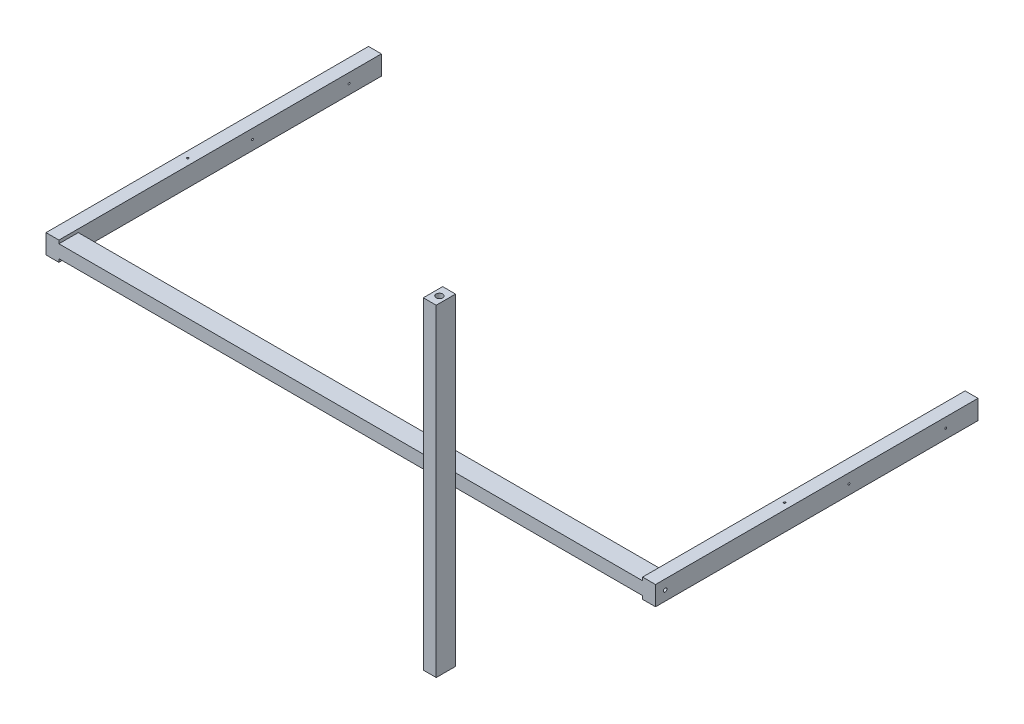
ISO-10303-21;
HEADER;
FILE_DESCRIPTION(('STEP AP214'),'2;1');
FILE_NAME('part.step','',(''),(''),'','','');
FILE_SCHEMA(('AUTOMOTIVE_DESIGN { 1 0 10303 214 1 1 1 1 }'));
ENDSEC;
DATA;
#1=APPLICATION_CONTEXT('core data for automotive mechanical design processes');
#2=APPLICATION_PROTOCOL_DEFINITION('international standard','automotive_design',2000,#1);
#3=PRODUCT_CONTEXT('',#1,'mechanical');
#4=PRODUCT('Part','Part','',(#3));
#5=PRODUCT_RELATED_PRODUCT_CATEGORY('part','',(#4));
#6=PRODUCT_DEFINITION_FORMATION('','',#4);
#7=PRODUCT_DEFINITION_CONTEXT('part definition',#1,'design');
#8=PRODUCT_DEFINITION('design','',#6,#7);
#9=PRODUCT_DEFINITION_SHAPE('','',#8);
#10=(LENGTH_UNIT() NAMED_UNIT(*) SI_UNIT(.MILLI.,.METRE.));
#11=(NAMED_UNIT(*) PLANE_ANGLE_UNIT() SI_UNIT($,.RADIAN.));
#12=(NAMED_UNIT(*) SI_UNIT($,.STERADIAN.) SOLID_ANGLE_UNIT());
#13=UNCERTAINTY_MEASURE_WITH_UNIT(LENGTH_MEASURE(1.E-05),#10,'distance_accuracy_value','');
#14=(GEOMETRIC_REPRESENTATION_CONTEXT(3) GLOBAL_UNCERTAINTY_ASSIGNED_CONTEXT((#13)) GLOBAL_UNIT_ASSIGNED_CONTEXT((#10,
#11,#12)) REPRESENTATION_CONTEXT('',''));
#15=CARTESIAN_POINT('',(0.,0.,0.));
#16=DIRECTION('',(0.,0.,1.));
#17=DIRECTION('',(1.,0.,0.));
#18=AXIS2_PLACEMENT_3D('',#15,#16,#17);
#19=CARTESIAN_POINT('',(285.,500.,1000.));
#20=DIRECTION('',(1.,0.,0.));
#21=DIRECTION('',(0.,0.,-1.));
#22=AXIS2_PLACEMENT_3D('',#19,#20,#21);
#23=PLANE('',#22);
#24=DIRECTION('',(0.,0.,1.));
#25=VECTOR('',#24,1.);
#26=CARTESIAN_POINT('',(285.,-500.,1000.));
#27=LINE('',#26,#25);
#28=CARTESIAN_POINT('',(285.,-500.,1000.));
#29=VERTEX_POINT('',#28);
#30=CARTESIAN_POINT('',(285.,-500.,1060.));
#31=VERTEX_POINT('',#30);
#32=EDGE_CURVE('E112',#29,#31,#27,.T.);
#33=ORIENTED_EDGE('',*,*,#32,.T.);
#34=DIRECTION('',(0.,-1.,0.));
#35=VECTOR('',#34,1.);
#36=CARTESIAN_POINT('',(285.,500.,1060.));
#37=LINE('',#36,#35);
#38=CARTESIAN_POINT('',(285.,500.,1060.));
#39=VERTEX_POINT('',#38);
#40=EDGE_CURVE('E12',#39,#31,#37,.T.);
#41=ORIENTED_EDGE('',*,*,#40,.F.);
#42=DIRECTION('',(0.,0.,1.));
#43=VECTOR('',#42,1.);
#44=CARTESIAN_POINT('',(285.,500.,1000.));
#45=LINE('',#44,#43);
#46=CARTESIAN_POINT('',(285.,500.,1000.));
#47=VERTEX_POINT('',#46);
#48=EDGE_CURVE('E99',#47,#39,#45,.T.);
#49=ORIENTED_EDGE('',*,*,#48,.F.);
#50=DIRECTION('',(0.,-1.,0.));
#51=VECTOR('',#50,1.);
#52=CARTESIAN_POINT('',(285.,500.,1000.));
#53=LINE('',#52,#51);
#54=EDGE_CURVE('E108',#47,#29,#53,.T.);
#55=ORIENTED_EDGE('',*,*,#54,.T.);
#56=EDGE_LOOP('',(#33,#41,#49,#55));
#57=FACE_BOUND('',#56,.T.);
#58=ADVANCED_FACE('F47',(#57),#23,.F.);
#59=CARTESIAN_POINT('',(285.,500.,1060.));
#60=DIRECTION('',(0.,0.,-1.));
#61=DIRECTION('',(-1.,0.,0.));
#62=AXIS2_PLACEMENT_3D('',#59,#60,#61);
#63=PLANE('',#62);
#64=DIRECTION('',(1.,0.,0.));
#65=VECTOR('',#64,1.);
#66=CARTESIAN_POINT('',(285.,-500.,1060.));
#67=LINE('',#66,#65);
#68=CARTESIAN_POINT('',(325.,-500.,1060.));
#69=VERTEX_POINT('',#68);
#70=EDGE_CURVE('E103',#31,#69,#67,.T.);
#71=ORIENTED_EDGE('',*,*,#70,.T.);
#72=DIRECTION('',(0.,-1.,0.));
#73=VECTOR('',#72,1.);
#74=CARTESIAN_POINT('',(325.,500.,1060.));
#75=LINE('',#74,#73);
#76=CARTESIAN_POINT('',(325.,500.,1060.));
#77=VERTEX_POINT('',#76);
#78=EDGE_CURVE('E56',#77,#69,#75,.T.);
#79=ORIENTED_EDGE('',*,*,#78,.F.);
#80=DIRECTION('',(1.,0.,0.));
#81=VECTOR('',#80,1.);
#82=CARTESIAN_POINT('',(285.,500.,1060.));
#83=LINE('',#82,#81);
#84=EDGE_CURVE('E94',#39,#77,#83,.T.);
#85=ORIENTED_EDGE('',*,*,#84,.F.);
#86=ORIENTED_EDGE('',*,*,#40,.T.);
#87=EDGE_LOOP('',(#71,#79,#85,#86));
#88=FACE_BOUND('',#87,.T.);
#89=ADVANCED_FACE('F102',(#88),#63,.F.);
#90=CARTESIAN_POINT('',(325.,500.,1000.));
#91=DIRECTION('',(-1.,0.,0.));
#92=DIRECTION('',(0.,0.,1.));
#93=AXIS2_PLACEMENT_3D('',#90,#91,#92);
#94=PLANE('',#93);
#95=DIRECTION('',(0.,0.,-1.));
#96=VECTOR('',#95,1.);
#97=CARTESIAN_POINT('',(325.,-500.,1000.));
#98=LINE('',#97,#96);
#99=CARTESIAN_POINT('',(325.,-500.,1000.));
#100=VERTEX_POINT('',#99);
#101=EDGE_CURVE('E81',#69,#100,#98,.T.);
#102=ORIENTED_EDGE('',*,*,#101,.T.);
#103=DIRECTION('',(0.,-1.,0.));
#104=VECTOR('',#103,1.);
#105=CARTESIAN_POINT('',(325.,500.,1000.));
#106=LINE('',#105,#104);
#107=CARTESIAN_POINT('',(325.,500.,1000.));
#108=VERTEX_POINT('',#107);
#109=EDGE_CURVE('E104',#108,#100,#106,.T.);
#110=ORIENTED_EDGE('',*,*,#109,.F.);
#111=DIRECTION('',(0.,0.,-1.));
#112=VECTOR('',#111,1.);
#113=CARTESIAN_POINT('',(325.,500.,1000.));
#114=LINE('',#113,#112);
#115=EDGE_CURVE('E97',#77,#108,#114,.T.);
#116=ORIENTED_EDGE('',*,*,#115,.F.);
#117=ORIENTED_EDGE('',*,*,#78,.T.);
#118=EDGE_LOOP('',(#102,#110,#116,#117));
#119=FACE_BOUND('',#118,.T.);
#120=ADVANCED_FACE('F106',(#119),#94,.F.);
#121=CARTESIAN_POINT('',(285.,500.,1000.));
#122=DIRECTION('',(0.,0.,1.));
#123=DIRECTION('',(1.,0.,0.));
#124=AXIS2_PLACEMENT_3D('',#121,#122,#123);
#125=PLANE('',#124);
#126=DIRECTION('',(-1.,0.,0.));
#127=VECTOR('',#126,1.);
#128=CARTESIAN_POINT('',(285.,-500.,1000.));
#129=LINE('',#128,#127);
#130=EDGE_CURVE('E87',#100,#29,#129,.T.);
#131=ORIENTED_EDGE('',*,*,#130,.T.);
#132=ORIENTED_EDGE('',*,*,#54,.F.);
#133=DIRECTION('',(-1.,0.,0.));
#134=VECTOR('',#133,1.);
#135=CARTESIAN_POINT('',(285.,500.,1000.));
#136=LINE('',#135,#134);
#137=EDGE_CURVE('E64',#108,#47,#136,.T.);
#138=ORIENTED_EDGE('',*,*,#137,.F.);
#139=ORIENTED_EDGE('',*,*,#109,.T.);
#140=EDGE_LOOP('',(#131,#132,#138,#139));
#141=FACE_BOUND('',#140,.T.);
#142=ADVANCED_FACE('F119',(#141),#125,.F.);
#143=CARTESIAN_POINT('',(0.,500.,0.));
#144=DIRECTION('',(0.,1.,0.));
#145=DIRECTION('',(0.,0.,1.));
#146=AXIS2_PLACEMENT_3D('',#143,#144,#145);
#147=PLANE('',#146);
#148=CARTESIAN_POINT('',(305.,500.,1030.));
#149=DIRECTION('',(0.,-1.,0.));
#150=DIRECTION('',(0.,0.,-1.));
#151=AXIS2_PLACEMENT_3D('',#148,#149,#150);
#152=CIRCLE('',#151,10.3434459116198);
#153=CARTESIAN_POINT('',(305.,500.,1019.65655408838));
#154=VERTEX_POINT('',#153);
#155=EDGE_CURVE('E125',#154,#154,#152,.T.);
#156=ORIENTED_EDGE('',*,*,#155,.T.);
#157=EDGE_LOOP('',(#156));
#158=FACE_BOUND('',#157,.T.);
#159=ORIENTED_EDGE('',*,*,#48,.T.);
#160=ORIENTED_EDGE('',*,*,#84,.T.);
#161=ORIENTED_EDGE('',*,*,#115,.T.);
#162=ORIENTED_EDGE('',*,*,#137,.T.);
#163=EDGE_LOOP('',(#159,#160,#161,#162));
#164=FACE_BOUND('',#163,.T.);
#165=ADVANCED_FACE('F95',(#158,#164),#147,.T.);
#166=CARTESIAN_POINT('',(0.,-500.,0.));
#167=DIRECTION('',(0.,1.,0.));
#168=DIRECTION('',(0.,0.,1.));
#169=AXIS2_PLACEMENT_3D('',#166,#167,#168);
#170=PLANE('',#169);
#171=CARTESIAN_POINT('',(305.,-500.,1030.));
#172=DIRECTION('',(0.,1.,0.));
#173=DIRECTION('',(0.,0.,1.));
#174=AXIS2_PLACEMENT_3D('',#171,#172,#173);
#175=CIRCLE('',#174,10.3434459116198);
#176=CARTESIAN_POINT('',(305.,-500.,1040.34344591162));
#177=VERTEX_POINT('',#176);
#178=EDGE_CURVE('E50',#177,#177,#175,.T.);
#179=ORIENTED_EDGE('',*,*,#178,.T.);
#180=EDGE_LOOP('',(#179));
#181=FACE_BOUND('',#180,.T.);
#182=ORIENTED_EDGE('',*,*,#32,.F.);
#183=ORIENTED_EDGE('',*,*,#130,.F.);
#184=ORIENTED_EDGE('',*,*,#101,.F.);
#185=ORIENTED_EDGE('',*,*,#70,.F.);
#186=EDGE_LOOP('',(#182,#183,#184,#185));
#187=FACE_BOUND('',#186,.T.);
#188=ADVANCED_FACE('F122',(#181,#187),#170,.F.);
#189=CARTESIAN_POINT('',(305.,500.,1030.));
#190=DIRECTION('',(0.,-1.,0.));
#191=DIRECTION('',(0.,0.,-1.));
#192=AXIS2_PLACEMENT_3D('',#189,#190,#191);
#193=CYLINDRICAL_SURFACE('',#192,10.3434459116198);
#194=ORIENTED_EDGE('',*,*,#155,.F.);
#195=EDGE_LOOP('',(#194));
#196=FACE_BOUND('',#195,.T.);
#197=ORIENTED_EDGE('',*,*,#178,.F.);
#198=EDGE_LOOP('',(#197));
#199=FACE_BOUND('',#198,.T.);
#200=ADVANCED_FACE('F133',(#196,#199),#193,.F.);
#201=CLOSED_SHELL('',(#58,#89,#120,#142,#165,#188,#200));
#202=MANIFOLD_SOLID_BREP('B2',#201);
#203=CARTESIAN_POINT('',(-905.,-30.,1000.));
#204=DIRECTION('',(-1.,0.,0.));
#205=DIRECTION('',(0.,0.,1.));
#206=AXIS2_PLACEMENT_3D('',#203,#204,#205);
#207=PLANE('',#206);
#208=CARTESIAN_POINT('',(-905.,0.,400.));
#209=DIRECTION('',(-1.,0.,0.));
#210=DIRECTION('',(0.,0.,1.));
#211=AXIS2_PLACEMENT_3D('',#208,#209,#210);
#212=CIRCLE('',#211,2.99999999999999);
#213=CARTESIAN_POINT('',(-905.,0.,403.));
#214=VERTEX_POINT('',#213);
#215=EDGE_CURVE('E495',#214,#214,#212,.T.);
#216=ORIENTED_EDGE('',*,*,#215,.T.);
#217=EDGE_LOOP('',(#216));
#218=FACE_BOUND('',#217,.T.);
#219=CARTESIAN_POINT('',(-905.,0.,100.));
#220=DIRECTION('',(-1.,0.,0.));
#221=DIRECTION('',(0.,0.,1.));
#222=AXIS2_PLACEMENT_3D('',#219,#220,#221);
#223=CIRCLE('',#222,2.99999999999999);
#224=CARTESIAN_POINT('',(-905.,0.,103.));
#225=VERTEX_POINT('',#224);
#226=EDGE_CURVE('E366',#225,#225,#223,.T.);
#227=ORIENTED_EDGE('',*,*,#226,.T.);
#228=EDGE_LOOP('',(#227));
#229=FACE_BOUND('',#228,.T.);
#230=DIRECTION('',(0.,0.,1.));
#231=VECTOR('',#230,1.);
#232=CARTESIAN_POINT('',(-905.,20.,940.));
#233=LINE('',#232,#231);
#234=CARTESIAN_POINT('',(-905.,20.,940.));
#235=VERTEX_POINT('',#234);
#236=CARTESIAN_POINT('',(-905.,20.,1000.));
#237=VERTEX_POINT('',#236);
#238=EDGE_CURVE('E209',#235,#237,#233,.T.);
#239=ORIENTED_EDGE('',*,*,#238,.F.);
#240=DIRECTION('',(0.,1.,0.));
#241=VECTOR('',#240,1.);
#242=CARTESIAN_POINT('',(-905.,-20.,940.));
#243=LINE('',#242,#241);
#244=CARTESIAN_POINT('',(-905.,-20.,940.));
#245=VERTEX_POINT('',#244);
#246=EDGE_CURVE('E313',#245,#235,#243,.T.);
#247=ORIENTED_EDGE('',*,*,#246,.F.);
#248=DIRECTION('',(0.,0.,-1.));
#249=VECTOR('',#248,1.);
#250=CARTESIAN_POINT('',(-905.,-20.,940.));
#251=LINE('',#250,#249);
#252=CARTESIAN_POINT('',(-905.,-20.,1000.));
#253=VERTEX_POINT('',#252);
#254=EDGE_CURVE('E310',#253,#245,#251,.T.);
#255=ORIENTED_EDGE('',*,*,#254,.F.);
#256=DIRECTION('',(0.,1.,0.));
#257=VECTOR('',#256,1.);
#258=CARTESIAN_POINT('',(-905.,-30.,1000.));
#259=LINE('',#258,#257);
#260=CARTESIAN_POINT('',(-905.,-30.,1000.));
#261=VERTEX_POINT('',#260);
#262=EDGE_CURVE('E345',#261,#253,#259,.T.);
#263=ORIENTED_EDGE('',*,*,#262,.F.);
#264=DIRECTION('',(0.,0.,-1.));
#265=VECTOR('',#264,1.);
#266=CARTESIAN_POINT('',(-905.,-30.,1000.));
#267=LINE('',#266,#265);
#268=CARTESIAN_POINT('',(-905.,-30.,0.));
#269=VERTEX_POINT('',#268);
#270=EDGE_CURVE('E201',#261,#269,#267,.T.);
#271=ORIENTED_EDGE('',*,*,#270,.T.);
#272=DIRECTION('',(0.,1.,0.));
#273=VECTOR('',#272,1.);
#274=CARTESIAN_POINT('',(-905.,-30.,0.));
#275=LINE('',#274,#273);
#276=CARTESIAN_POINT('',(-905.,30.,0.));
#277=VERTEX_POINT('',#276);
#278=EDGE_CURVE('E354',#269,#277,#275,.T.);
#279=ORIENTED_EDGE('',*,*,#278,.T.);
#280=DIRECTION('',(0.,0.,-1.));
#281=VECTOR('',#280,1.);
#282=CARTESIAN_POINT('',(-905.,30.,1000.));
#283=LINE('',#282,#281);
#284=CARTESIAN_POINT('',(-905.,30.,1000.));
#285=VERTEX_POINT('',#284);
#286=EDGE_CURVE('E359',#285,#277,#283,.T.);
#287=ORIENTED_EDGE('',*,*,#286,.F.);
#288=EDGE_CURVE('E214',#237,#285,#259,.T.);
#289=ORIENTED_EDGE('',*,*,#288,.F.);
#290=EDGE_LOOP('',(#239,#247,#255,#263,#271,#279,#287,#289));
#291=FACE_BOUND('',#290,.T.);
#292=ADVANCED_FACE('F192',(#218,#229,#291),#207,.F.);
#293=CARTESIAN_POINT('',(-945.,-30.,1000.));
#294=DIRECTION('',(1.,0.,0.));
#295=DIRECTION('',(0.,0.,-1.));
#296=AXIS2_PLACEMENT_3D('',#293,#294,#295);
#297=PLANE('',#296);
#298=CARTESIAN_POINT('',(-945.,0.,970.));
#299=DIRECTION('',(-1.,0.,0.));
#300=DIRECTION('',(0.,0.,1.));
#301=AXIS2_PLACEMENT_3D('',#298,#299,#300);
#302=CIRCLE('',#301,5.49999999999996);
#303=CARTESIAN_POINT('',(-945.,0.,975.5));
#304=VERTEX_POINT('',#303);
#305=EDGE_CURVE('E504',#304,#304,#302,.T.);
#306=ORIENTED_EDGE('',*,*,#305,.F.);
#307=EDGE_LOOP('',(#306));
#308=FACE_BOUND('',#307,.T.);
#309=CARTESIAN_POINT('',(-945.,0.,400.));
#310=DIRECTION('',(-1.,0.,0.));
#311=DIRECTION('',(0.,0.,1.));
#312=AXIS2_PLACEMENT_3D('',#309,#310,#311);
#313=CIRCLE('',#312,2.99999999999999);
#314=CARTESIAN_POINT('',(-945.,0.,403.));
#315=VERTEX_POINT('',#314);
#316=EDGE_CURVE('E501',#315,#315,#313,.T.);
#317=ORIENTED_EDGE('',*,*,#316,.F.);
#318=EDGE_LOOP('',(#317));
#319=FACE_BOUND('',#318,.T.);
#320=CARTESIAN_POINT('',(-945.,0.,100.));
#321=DIRECTION('',(-1.,0.,0.));
#322=DIRECTION('',(0.,0.,1.));
#323=AXIS2_PLACEMENT_3D('',#320,#321,#322);
#324=CIRCLE('',#323,2.99999999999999);
#325=CARTESIAN_POINT('',(-945.,0.,103.));
#326=VERTEX_POINT('',#325);
#327=EDGE_CURVE('E498',#326,#326,#324,.T.);
#328=ORIENTED_EDGE('',*,*,#327,.F.);
#329=EDGE_LOOP('',(#328));
#330=FACE_BOUND('',#329,.T.);
#331=DIRECTION('',(0.,-1.,0.));
#332=VECTOR('',#331,1.);
#333=CARTESIAN_POINT('',(-945.,-30.,0.));
#334=LINE('',#333,#332);
#335=CARTESIAN_POINT('',(-945.,30.,0.));
#336=VERTEX_POINT('',#335);
#337=CARTESIAN_POINT('',(-945.,-30.,0.));
#338=VERTEX_POINT('',#337);
#339=EDGE_CURVE('E339',#336,#338,#334,.T.);
#340=ORIENTED_EDGE('',*,*,#339,.T.);
#341=DIRECTION('',(0.,0.,-1.));
#342=VECTOR('',#341,1.);
#343=CARTESIAN_POINT('',(-945.,-30.,1000.));
#344=LINE('',#343,#342);
#345=CARTESIAN_POINT('',(-945.,-30.,1000.));
#346=VERTEX_POINT('',#345);
#347=EDGE_CURVE('E45',#346,#338,#344,.T.);
#348=ORIENTED_EDGE('',*,*,#347,.F.);
#349=DIRECTION('',(0.,-1.,0.));
#350=VECTOR('',#349,1.);
#351=CARTESIAN_POINT('',(-945.,-30.,1000.));
#352=LINE('',#351,#350);
#353=CARTESIAN_POINT('',(-945.,30.,1000.));
#354=VERTEX_POINT('',#353);
#355=EDGE_CURVE('E340',#354,#346,#352,.T.);
#356=ORIENTED_EDGE('',*,*,#355,.F.);
#357=DIRECTION('',(0.,0.,-1.));
#358=VECTOR('',#357,1.);
#359=CARTESIAN_POINT('',(-945.,30.,1000.));
#360=LINE('',#359,#358);
#361=EDGE_CURVE('E349',#354,#336,#360,.T.);
#362=ORIENTED_EDGE('',*,*,#361,.T.);
#363=EDGE_LOOP('',(#340,#348,#356,#362));
#364=FACE_BOUND('',#363,.T.);
#365=ADVANCED_FACE('F194',(#308,#319,#330,#364),#297,.F.);
#366=CARTESIAN_POINT('',(-905.,-30.,1000.));
#367=DIRECTION('',(0.,1.,0.));
#368=DIRECTION('',(-1.,0.,0.));
#369=AXIS2_PLACEMENT_3D('',#366,#367,#368);
#370=PLANE('',#369);
#371=CARTESIAN_POINT('',(-925.,-30.,580.));
#372=DIRECTION('',(0.,1.,0.));
#373=DIRECTION('',(-1.,0.,0.));
#374=AXIS2_PLACEMENT_3D('',#371,#372,#373);
#375=CIRCLE('',#374,3.00000000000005);
#376=CARTESIAN_POINT('',(-928.,-30.,580.));
#377=VERTEX_POINT('',#376);
#378=EDGE_CURVE('E381',#377,#377,#375,.T.);
#379=ORIENTED_EDGE('',*,*,#378,.T.);
#380=EDGE_LOOP('',(#379));
#381=FACE_BOUND('',#380,.T.);
#382=DIRECTION('',(1.,0.,0.));
#383=VECTOR('',#382,1.);
#384=CARTESIAN_POINT('',(-905.,-30.,0.));
#385=LINE('',#384,#383);
#386=EDGE_CURVE('E352',#338,#269,#385,.T.);
#387=ORIENTED_EDGE('',*,*,#386,.T.);
#388=ORIENTED_EDGE('',*,*,#270,.F.);
#389=DIRECTION('',(1.,0.,0.));
#390=VECTOR('',#389,1.);
#391=CARTESIAN_POINT('',(-905.,-30.,1000.));
#392=LINE('',#391,#390);
#393=EDGE_CURVE('E342',#346,#261,#392,.T.);
#394=ORIENTED_EDGE('',*,*,#393,.F.);
#395=ORIENTED_EDGE('',*,*,#347,.T.);
#396=EDGE_LOOP('',(#387,#388,#394,#395));
#397=FACE_BOUND('',#396,.T.);
#398=ADVANCED_FACE('F425',(#381,#397),#370,.F.);
#399=CARTESIAN_POINT('',(-905.,30.,1000.));
#400=DIRECTION('',(0.,-1.,0.));
#401=DIRECTION('',(1.,0.,0.));
#402=AXIS2_PLACEMENT_3D('',#399,#400,#401);
#403=PLANE('',#402);
#404=CARTESIAN_POINT('',(-925.,30.,580.));
#405=DIRECTION('',(0.,-1.,0.));
#406=DIRECTION('',(1.,0.,0.));
#407=AXIS2_PLACEMENT_3D('',#404,#405,#406);
#408=CIRCLE('',#407,3.00000000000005);
#409=CARTESIAN_POINT('',(-922.,30.,580.));
#410=VERTEX_POINT('',#409);
#411=EDGE_CURVE('E196',#410,#410,#408,.T.);
#412=ORIENTED_EDGE('',*,*,#411,.T.);
#413=EDGE_LOOP('',(#412));
#414=FACE_BOUND('',#413,.T.);
#415=DIRECTION('',(-1.,0.,0.));
#416=VECTOR('',#415,1.);
#417=CARTESIAN_POINT('',(-905.,30.,0.));
#418=LINE('',#417,#416);
#419=EDGE_CURVE('E343',#277,#336,#418,.T.);
#420=ORIENTED_EDGE('',*,*,#419,.T.);
#421=ORIENTED_EDGE('',*,*,#361,.F.);
#422=DIRECTION('',(-1.,0.,0.));
#423=VECTOR('',#422,1.);
#424=CARTESIAN_POINT('',(-905.,30.,1000.));
#425=LINE('',#424,#423);
#426=EDGE_CURVE('E347',#285,#354,#425,.T.);
#427=ORIENTED_EDGE('',*,*,#426,.F.);
#428=ORIENTED_EDGE('',*,*,#286,.T.);
#429=EDGE_LOOP('',(#420,#421,#427,#428));
#430=FACE_BOUND('',#429,.T.);
#431=ADVANCED_FACE('F417',(#414,#430),#403,.F.);
#432=CARTESIAN_POINT('',(0.,0.,1000.));
#433=DIRECTION('',(0.,0.,1.));
#434=DIRECTION('',(1.,0.,0.));
#435=AXIS2_PLACEMENT_3D('',#432,#433,#434);
#436=PLANE('',#435);
#437=ORIENTED_EDGE('',*,*,#355,.T.);
#438=ORIENTED_EDGE('',*,*,#393,.T.);
#439=ORIENTED_EDGE('',*,*,#262,.T.);
#440=DIRECTION('',(-1.,0.,0.));
#441=VECTOR('',#440,1.);
#442=CARTESIAN_POINT('',(905.,-20.,1000.));
#443=LINE('',#442,#441);
#444=CARTESIAN_POINT('',(905.,-20.,1000.));
#445=VERTEX_POINT('',#444);
#446=EDGE_CURVE('E289',#445,#253,#443,.T.);
#447=ORIENTED_EDGE('',*,*,#446,.F.);
#448=DIRECTION('',(0.,-1.,0.));
#449=VECTOR('',#448,1.);
#450=CARTESIAN_POINT('',(905.,-30.,1000.));
#451=LINE('',#450,#449);
#452=CARTESIAN_POINT('',(905.,-30.,1000.));
#453=VERTEX_POINT('',#452);
#454=EDGE_CURVE('E281',#445,#453,#451,.T.);
#455=ORIENTED_EDGE('',*,*,#454,.T.);
#456=DIRECTION('',(1.,0.,0.));
#457=VECTOR('',#456,1.);
#458=CARTESIAN_POINT('',(905.,-30.,1000.));
#459=LINE('',#458,#457);
#460=CARTESIAN_POINT('',(945.,-30.,1000.));
#461=VERTEX_POINT('',#460);
#462=EDGE_CURVE('E285',#453,#461,#459,.T.);
#463=ORIENTED_EDGE('',*,*,#462,.T.);
#464=DIRECTION('',(0.,1.,0.));
#465=VECTOR('',#464,1.);
#466=CARTESIAN_POINT('',(945.,-30.,1000.));
#467=LINE('',#466,#465);
#468=CARTESIAN_POINT('',(945.,30.,1000.));
#469=VERTEX_POINT('',#468);
#470=EDGE_CURVE('E304',#461,#469,#467,.T.);
#471=ORIENTED_EDGE('',*,*,#470,.T.);
#472=DIRECTION('',(-1.,0.,0.));
#473=VECTOR('',#472,1.);
#474=CARTESIAN_POINT('',(905.,30.,1000.));
#475=LINE('',#474,#473);
#476=CARTESIAN_POINT('',(905.,30.,1000.));
#477=VERTEX_POINT('',#476);
#478=EDGE_CURVE('E386',#469,#477,#475,.T.);
#479=ORIENTED_EDGE('',*,*,#478,.T.);
#480=CARTESIAN_POINT('',(905.,20.,1000.));
#481=VERTEX_POINT('',#480);
#482=EDGE_CURVE('E293',#477,#481,#451,.T.);
#483=ORIENTED_EDGE('',*,*,#482,.T.);
#484=DIRECTION('',(-1.,0.,0.));
#485=VECTOR('',#484,1.);
#486=CARTESIAN_POINT('',(905.,20.,1000.));
#487=LINE('',#486,#485);
#488=EDGE_CURVE('E326',#481,#237,#487,.T.);
#489=ORIENTED_EDGE('',*,*,#488,.T.);
#490=ORIENTED_EDGE('',*,*,#288,.T.);
#491=ORIENTED_EDGE('',*,*,#426,.T.);
#492=EDGE_LOOP('',(#437,#438,#439,#447,#455,#463,#471,#479,#483,#489,#490,#491));
#493=FACE_BOUND('',#492,.T.);
#494=ADVANCED_FACE('F284',(#493),#436,.T.);
#495=CARTESIAN_POINT('',(0.,0.,0.));
#496=DIRECTION('',(0.,0.,1.));
#497=DIRECTION('',(1.,0.,0.));
#498=AXIS2_PLACEMENT_3D('',#495,#496,#497);
#499=PLANE('',#498);
#500=ORIENTED_EDGE('',*,*,#339,.F.);
#501=ORIENTED_EDGE('',*,*,#419,.F.);
#502=ORIENTED_EDGE('',*,*,#278,.F.);
#503=ORIENTED_EDGE('',*,*,#386,.F.);
#504=EDGE_LOOP('',(#500,#501,#502,#503));
#505=FACE_BOUND('',#504,.T.);
#506=ADVANCED_FACE('F437',(#505),#499,.F.);
#507=CARTESIAN_POINT('',(905.,-20.,940.));
#508=DIRECTION('',(0.,1.,0.));
#509=DIRECTION('',(0.,0.,1.));
#510=AXIS2_PLACEMENT_3D('',#507,#508,#509);
#511=PLANE('',#510);
#512=ORIENTED_EDGE('',*,*,#254,.T.);
#513=DIRECTION('',(-1.,0.,0.));
#514=VECTOR('',#513,1.);
#515=CARTESIAN_POINT('',(905.,-20.,940.));
#516=LINE('',#515,#514);
#517=CARTESIAN_POINT('',(905.,-20.,940.));
#518=VERTEX_POINT('',#517);
#519=EDGE_CURVE('E335',#518,#245,#516,.T.);
#520=ORIENTED_EDGE('',*,*,#519,.F.);
#521=DIRECTION('',(0.,0.,-1.));
#522=VECTOR('',#521,1.);
#523=CARTESIAN_POINT('',(905.,-20.,940.));
#524=LINE('',#523,#522);
#525=EDGE_CURVE('E319',#445,#518,#524,.T.);
#526=ORIENTED_EDGE('',*,*,#525,.F.);
#527=ORIENTED_EDGE('',*,*,#446,.T.);
#528=EDGE_LOOP('',(#512,#520,#526,#527));
#529=FACE_BOUND('',#528,.T.);
#530=ADVANCED_FACE('F427',(#529),#511,.F.);
#531=CARTESIAN_POINT('',(905.,-20.,940.));
#532=DIRECTION('',(0.,0.,1.));
#533=DIRECTION('',(1.,0.,0.));
#534=AXIS2_PLACEMENT_3D('',#531,#532,#533);
#535=PLANE('',#534);
#536=ORIENTED_EDGE('',*,*,#246,.T.);
#537=DIRECTION('',(-1.,0.,0.));
#538=VECTOR('',#537,1.);
#539=CARTESIAN_POINT('',(905.,20.,940.));
#540=LINE('',#539,#538);
#541=CARTESIAN_POINT('',(905.,20.,940.));
#542=VERTEX_POINT('',#541);
#543=EDGE_CURVE('E332',#542,#235,#540,.T.);
#544=ORIENTED_EDGE('',*,*,#543,.F.);
#545=DIRECTION('',(0.,1.,0.));
#546=VECTOR('',#545,1.);
#547=CARTESIAN_POINT('',(905.,-20.,940.));
#548=LINE('',#547,#546);
#549=EDGE_CURVE('E321',#518,#542,#548,.T.);
#550=ORIENTED_EDGE('',*,*,#549,.F.);
#551=ORIENTED_EDGE('',*,*,#519,.T.);
#552=EDGE_LOOP('',(#536,#544,#550,#551));
#553=FACE_BOUND('',#552,.T.);
#554=ADVANCED_FACE('F429',(#553),#535,.F.);
#555=CARTESIAN_POINT('',(905.,20.,940.));
#556=DIRECTION('',(0.,-1.,0.));
#557=DIRECTION('',(0.,0.,-1.));
#558=AXIS2_PLACEMENT_3D('',#555,#556,#557);
#559=PLANE('',#558);
#560=ORIENTED_EDGE('',*,*,#238,.T.);
#561=ORIENTED_EDGE('',*,*,#488,.F.);
#562=DIRECTION('',(0.,0.,1.));
#563=VECTOR('',#562,1.);
#564=CARTESIAN_POINT('',(905.,20.,940.));
#565=LINE('',#564,#563);
#566=EDGE_CURVE('E324',#542,#481,#565,.T.);
#567=ORIENTED_EDGE('',*,*,#566,.F.);
#568=ORIENTED_EDGE('',*,*,#543,.T.);
#569=EDGE_LOOP('',(#560,#561,#567,#568));
#570=FACE_BOUND('',#569,.T.);
#571=ADVANCED_FACE('F411',(#570),#559,.F.);
#572=CARTESIAN_POINT('',(905.,-30.,1000.));
#573=DIRECTION('',(1.,0.,0.));
#574=DIRECTION('',(0.,0.,-1.));
#575=AXIS2_PLACEMENT_3D('',#572,#573,#574);
#576=PLANE('',#575);
#577=CARTESIAN_POINT('',(905.,0.,400.));
#578=DIRECTION('',(1.,0.,0.));
#579=DIRECTION('',(0.,0.,-1.));
#580=AXIS2_PLACEMENT_3D('',#577,#578,#579);
#581=CIRCLE('',#580,2.99999999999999);
#582=CARTESIAN_POINT('',(905.,0.,397.));
#583=VERTEX_POINT('',#582);
#584=EDGE_CURVE('E491',#583,#583,#581,.T.);
#585=ORIENTED_EDGE('',*,*,#584,.T.);
#586=EDGE_LOOP('',(#585));
#587=FACE_BOUND('',#586,.T.);
#588=CARTESIAN_POINT('',(905.,0.,100.));
#589=DIRECTION('',(1.,0.,0.));
#590=DIRECTION('',(0.,0.,-1.));
#591=AXIS2_PLACEMENT_3D('',#588,#589,#590);
#592=CIRCLE('',#591,2.99999999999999);
#593=CARTESIAN_POINT('',(905.,0.,97.));
#594=VERTEX_POINT('',#593);
#595=EDGE_CURVE('E372',#594,#594,#592,.T.);
#596=ORIENTED_EDGE('',*,*,#595,.T.);
#597=EDGE_LOOP('',(#596));
#598=FACE_BOUND('',#597,.T.);
#599=ORIENTED_EDGE('',*,*,#454,.F.);
#600=ORIENTED_EDGE('',*,*,#525,.T.);
#601=ORIENTED_EDGE('',*,*,#549,.T.);
#602=ORIENTED_EDGE('',*,*,#566,.T.);
#603=ORIENTED_EDGE('',*,*,#482,.F.);
#604=DIRECTION('',(0.,0.,-1.));
#605=VECTOR('',#604,1.);
#606=CARTESIAN_POINT('',(905.,30.,1000.));
#607=LINE('',#606,#605);
#608=CARTESIAN_POINT('',(905.,30.,0.));
#609=VERTEX_POINT('',#608);
#610=EDGE_CURVE('E388',#477,#609,#607,.T.);
#611=ORIENTED_EDGE('',*,*,#610,.T.);
#612=DIRECTION('',(0.,-1.,0.));
#613=VECTOR('',#612,1.);
#614=CARTESIAN_POINT('',(905.,-30.,0.));
#615=LINE('',#614,#613);
#616=CARTESIAN_POINT('',(905.,-30.,0.));
#617=VERTEX_POINT('',#616);
#618=EDGE_CURVE('E309',#609,#617,#615,.T.);
#619=ORIENTED_EDGE('',*,*,#618,.T.);
#620=DIRECTION('',(0.,0.,-1.));
#621=VECTOR('',#620,1.);
#622=CARTESIAN_POINT('',(905.,-30.,1000.));
#623=LINE('',#622,#621);
#624=EDGE_CURVE('E299',#453,#617,#623,.T.);
#625=ORIENTED_EDGE('',*,*,#624,.F.);
#626=EDGE_LOOP('',(#599,#600,#601,#602,#603,#611,#619,#625));
#627=FACE_BOUND('',#626,.T.);
#628=ADVANCED_FACE('F306',(#587,#598,#627),#576,.F.);
#629=CARTESIAN_POINT('',(905.,-30.,1000.));
#630=DIRECTION('',(0.,1.,0.));
#631=DIRECTION('',(-1.,0.,0.));
#632=AXIS2_PLACEMENT_3D('',#629,#630,#631);
#633=PLANE('',#632);
#634=CARTESIAN_POINT('',(925.,-30.,580.));
#635=DIRECTION('',(0.,1.,0.));
#636=DIRECTION('',(-1.,0.,0.));
#637=AXIS2_PLACEMENT_3D('',#634,#635,#636);
#638=CIRCLE('',#637,3.00000000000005);
#639=CARTESIAN_POINT('',(922.,-30.,580.));
#640=VERTEX_POINT('',#639);
#641=EDGE_CURVE('E365',#640,#640,#638,.T.);
#642=ORIENTED_EDGE('',*,*,#641,.T.);
#643=EDGE_LOOP('',(#642));
#644=FACE_BOUND('',#643,.T.);
#645=DIRECTION('',(1.,0.,0.));
#646=VECTOR('',#645,1.);
#647=CARTESIAN_POINT('',(905.,-30.,0.));
#648=LINE('',#647,#646);
#649=CARTESIAN_POINT('',(945.,-30.,0.));
#650=VERTEX_POINT('',#649);
#651=EDGE_CURVE('E390',#617,#650,#648,.T.);
#652=ORIENTED_EDGE('',*,*,#651,.T.);
#653=DIRECTION('',(0.,0.,-1.));
#654=VECTOR('',#653,1.);
#655=CARTESIAN_POINT('',(945.,-30.,1000.));
#656=LINE('',#655,#654);
#657=EDGE_CURVE('E302',#461,#650,#656,.T.);
#658=ORIENTED_EDGE('',*,*,#657,.F.);
#659=ORIENTED_EDGE('',*,*,#462,.F.);
#660=ORIENTED_EDGE('',*,*,#624,.T.);
#661=EDGE_LOOP('',(#652,#658,#659,#660));
#662=FACE_BOUND('',#661,.T.);
#663=ADVANCED_FACE('F298',(#644,#662),#633,.F.);
#664=CARTESIAN_POINT('',(945.,-30.,1000.));
#665=DIRECTION('',(-1.,0.,0.));
#666=DIRECTION('',(0.,0.,1.));
#667=AXIS2_PLACEMENT_3D('',#664,#665,#666);
#668=PLANE('',#667);
#669=CARTESIAN_POINT('',(945.,0.,970.));
#670=DIRECTION('',(-1.,0.,0.));
#671=DIRECTION('',(0.,0.,1.));
#672=AXIS2_PLACEMENT_3D('',#669,#670,#671);
#673=CIRCLE('',#672,5.49999999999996);
#674=CARTESIAN_POINT('',(945.,0.,975.5));
#675=VERTEX_POINT('',#674);
#676=EDGE_CURVE('E534',#675,#675,#673,.T.);
#677=ORIENTED_EDGE('',*,*,#676,.T.);
#678=EDGE_LOOP('',(#677));
#679=FACE_BOUND('',#678,.T.);
#680=CARTESIAN_POINT('',(945.,0.,400.));
#681=DIRECTION('',(-1.,0.,0.));
#682=DIRECTION('',(0.,0.,1.));
#683=AXIS2_PLACEMENT_3D('',#680,#681,#682);
#684=CIRCLE('',#683,2.99999999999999);
#685=CARTESIAN_POINT('',(945.,0.,403.));
#686=VERTEX_POINT('',#685);
#687=EDGE_CURVE('E496',#686,#686,#684,.T.);
#688=ORIENTED_EDGE('',*,*,#687,.T.);
#689=EDGE_LOOP('',(#688));
#690=FACE_BOUND('',#689,.T.);
#691=CARTESIAN_POINT('',(945.,0.,100.));
#692=DIRECTION('',(-1.,0.,0.));
#693=DIRECTION('',(0.,0.,1.));
#694=AXIS2_PLACEMENT_3D('',#691,#692,#693);
#695=CIRCLE('',#694,2.99999999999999);
#696=CARTESIAN_POINT('',(945.,0.,103.));
#697=VERTEX_POINT('',#696);
#698=EDGE_CURVE('E377',#697,#697,#695,.T.);
#699=ORIENTED_EDGE('',*,*,#698,.T.);
#700=EDGE_LOOP('',(#699));
#701=FACE_BOUND('',#700,.T.);
#702=DIRECTION('',(0.,1.,0.));
#703=VECTOR('',#702,1.);
#704=CARTESIAN_POINT('',(945.,-30.,0.));
#705=LINE('',#704,#703);
#706=CARTESIAN_POINT('',(945.,30.,0.));
#707=VERTEX_POINT('',#706);
#708=EDGE_CURVE('E392',#650,#707,#705,.T.);
#709=ORIENTED_EDGE('',*,*,#708,.T.);
#710=DIRECTION('',(0.,0.,-1.));
#711=VECTOR('',#710,1.);
#712=CARTESIAN_POINT('',(945.,30.,1000.));
#713=LINE('',#712,#711);
#714=EDGE_CURVE('E315',#469,#707,#713,.T.);
#715=ORIENTED_EDGE('',*,*,#714,.F.);
#716=ORIENTED_EDGE('',*,*,#470,.F.);
#717=ORIENTED_EDGE('',*,*,#657,.T.);
#718=EDGE_LOOP('',(#709,#715,#716,#717));
#719=FACE_BOUND('',#718,.T.);
#720=ADVANCED_FACE('F406',(#679,#690,#701,#719),#668,.F.);
#721=CARTESIAN_POINT('',(905.,30.,1000.));
#722=DIRECTION('',(0.,-1.,0.));
#723=DIRECTION('',(1.,0.,0.));
#724=AXIS2_PLACEMENT_3D('',#721,#722,#723);
#725=PLANE('',#724);
#726=CARTESIAN_POINT('',(925.,30.,580.));
#727=DIRECTION('',(0.,-1.,0.));
#728=DIRECTION('',(1.,0.,0.));
#729=AXIS2_PLACEMENT_3D('',#726,#727,#728);
#730=CIRCLE('',#729,3.00000000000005);
#731=CARTESIAN_POINT('',(928.,30.,580.));
#732=VERTEX_POINT('',#731);
#733=EDGE_CURVE('E363',#732,#732,#730,.T.);
#734=ORIENTED_EDGE('',*,*,#733,.T.);
#735=EDGE_LOOP('',(#734));
#736=FACE_BOUND('',#735,.T.);
#737=DIRECTION('',(-1.,0.,0.));
#738=VECTOR('',#737,1.);
#739=CARTESIAN_POINT('',(905.,30.,0.));
#740=LINE('',#739,#738);
#741=EDGE_CURVE('E294',#707,#609,#740,.T.);
#742=ORIENTED_EDGE('',*,*,#741,.T.);
#743=ORIENTED_EDGE('',*,*,#610,.F.);
#744=ORIENTED_EDGE('',*,*,#478,.F.);
#745=ORIENTED_EDGE('',*,*,#714,.T.);
#746=EDGE_LOOP('',(#742,#743,#744,#745));
#747=FACE_BOUND('',#746,.T.);
#748=ADVANCED_FACE('F400',(#736,#747),#725,.F.);
#749=CARTESIAN_POINT('',(0.,0.,0.));
#750=DIRECTION('',(0.,0.,-1.));
#751=DIRECTION('',(-1.,0.,0.));
#752=AXIS2_PLACEMENT_3D('',#749,#750,#751);
#753=PLANE('',#752);
#754=ORIENTED_EDGE('',*,*,#618,.F.);
#755=ORIENTED_EDGE('',*,*,#741,.F.);
#756=ORIENTED_EDGE('',*,*,#708,.F.);
#757=ORIENTED_EDGE('',*,*,#651,.F.);
#758=EDGE_LOOP('',(#754,#755,#756,#757));
#759=FACE_BOUND('',#758,.T.);
#760=ADVANCED_FACE('F405',(#759),#753,.T.);
#761=CARTESIAN_POINT('',(925.,500.,580.));
#762=DIRECTION('',(0.,-1.,0.));
#763=DIRECTION('',(0.,0.,-1.));
#764=AXIS2_PLACEMENT_3D('',#761,#762,#763);
#765=CYLINDRICAL_SURFACE('',#764,3.00000000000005);
#766=ORIENTED_EDGE('',*,*,#733,.F.);
#767=EDGE_LOOP('',(#766));
#768=FACE_BOUND('',#767,.T.);
#769=ORIENTED_EDGE('',*,*,#641,.F.);
#770=EDGE_LOOP('',(#769));
#771=FACE_BOUND('',#770,.T.);
#772=ADVANCED_FACE('F460',(#768,#771),#765,.F.);
#773=CARTESIAN_POINT('',(-925.,500.,580.));
#774=DIRECTION('',(0.,-1.,0.));
#775=DIRECTION('',(0.,0.,-1.));
#776=AXIS2_PLACEMENT_3D('',#773,#774,#775);
#777=CYLINDRICAL_SURFACE('',#776,3.00000000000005);
#778=ORIENTED_EDGE('',*,*,#411,.F.);
#779=EDGE_LOOP('',(#778));
#780=FACE_BOUND('',#779,.T.);
#781=ORIENTED_EDGE('',*,*,#378,.F.);
#782=EDGE_LOOP('',(#781));
#783=FACE_BOUND('',#782,.T.);
#784=ADVANCED_FACE('F457',(#780,#783),#777,.F.);
#785=CARTESIAN_POINT('',(945.,0.,100.));
#786=DIRECTION('',(-1.,0.,0.));
#787=DIRECTION('',(0.,0.,1.));
#788=AXIS2_PLACEMENT_3D('',#785,#786,#787);
#789=CYLINDRICAL_SURFACE('',#788,2.99999999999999);
#790=ORIENTED_EDGE('',*,*,#698,.F.);
#791=EDGE_LOOP('',(#790));
#792=FACE_BOUND('',#791,.T.);
#793=ORIENTED_EDGE('',*,*,#595,.F.);
#794=EDGE_LOOP('',(#793));
#795=FACE_BOUND('',#794,.T.);
#796=ADVANCED_FACE('F459',(#792,#795),#789,.F.);
#797=ORIENTED_EDGE('',*,*,#327,.T.);
#798=EDGE_LOOP('',(#797));
#799=FACE_BOUND('',#798,.T.);
#800=ORIENTED_EDGE('',*,*,#226,.F.);
#801=EDGE_LOOP('',(#800));
#802=FACE_BOUND('',#801,.T.);
#803=ADVANCED_FACE('F467',(#799,#802),#789,.F.);
#804=CARTESIAN_POINT('',(945.,0.,400.));
#805=DIRECTION('',(-1.,0.,0.));
#806=DIRECTION('',(0.,0.,1.));
#807=AXIS2_PLACEMENT_3D('',#804,#805,#806);
#808=CYLINDRICAL_SURFACE('',#807,2.99999999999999);
#809=ORIENTED_EDGE('',*,*,#687,.F.);
#810=EDGE_LOOP('',(#809));
#811=FACE_BOUND('',#810,.T.);
#812=ORIENTED_EDGE('',*,*,#584,.F.);
#813=EDGE_LOOP('',(#812));
#814=FACE_BOUND('',#813,.T.);
#815=ADVANCED_FACE('F514',(#811,#814),#808,.F.);
#816=CARTESIAN_POINT('',(945.,0.,970.));
#817=DIRECTION('',(-1.,0.,0.));
#818=DIRECTION('',(0.,0.,1.));
#819=AXIS2_PLACEMENT_3D('',#816,#817,#818);
#820=CYLINDRICAL_SURFACE('',#819,5.49999999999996);
#821=ORIENTED_EDGE('',*,*,#676,.F.);
#822=EDGE_LOOP('',(#821));
#823=FACE_BOUND('',#822,.T.);
#824=ORIENTED_EDGE('',*,*,#305,.T.);
#825=EDGE_LOOP('',(#824));
#826=FACE_BOUND('',#825,.T.);
#827=ADVANCED_FACE('F518',(#823,#826),#820,.F.);
#828=ORIENTED_EDGE('',*,*,#316,.T.);
#829=EDGE_LOOP('',(#828));
#830=FACE_BOUND('',#829,.T.);
#831=ORIENTED_EDGE('',*,*,#215,.F.);
#832=EDGE_LOOP('',(#831));
#833=FACE_BOUND('',#832,.T.);
#834=ADVANCED_FACE('F521',(#830,#833),#808,.F.);
#835=CLOSED_SHELL('',(#292,#365,#398,#431,#494,#506,#530,#554,#571,#628,#663,#720,#748,#760,
#772,#784,#796,#803,#815,#827,#834));
#836=MANIFOLD_SOLID_BREP('B6',#835);
#837=ADVANCED_BREP_SHAPE_REPRESENTATION('',(#18,#202,#836),#14);
#838=SHAPE_DEFINITION_REPRESENTATION(#9,#837);
ENDSEC;
END-ISO-10303-21;
